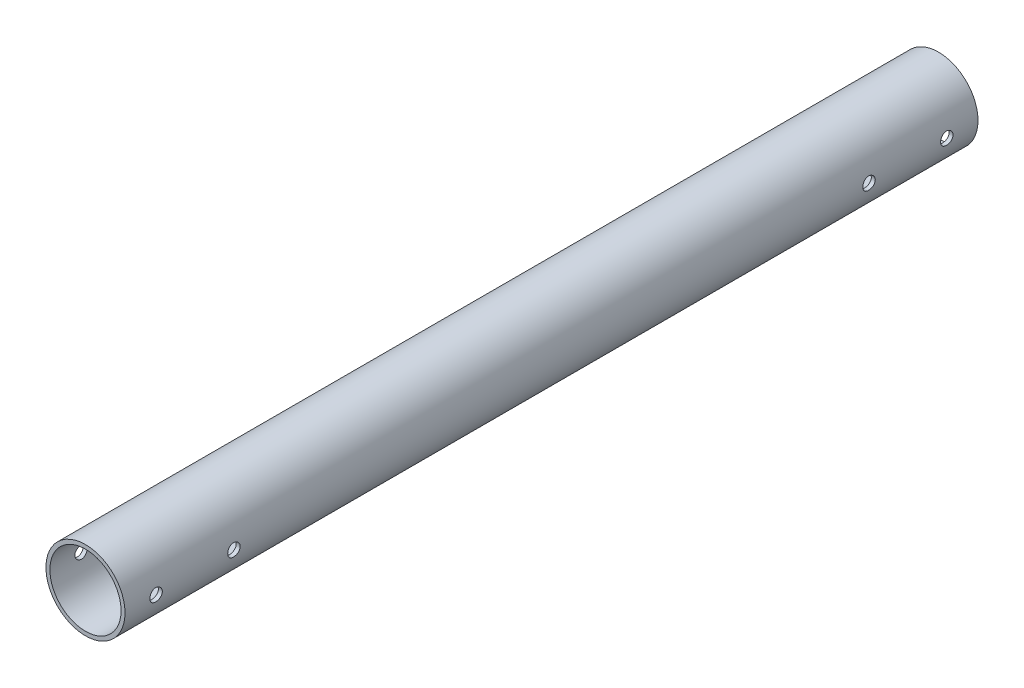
from build123d import *

# Parameters (mm, degrees)
SKETCH1_R               = 12.7
SKETCH1_R_2             = 11.43
BOSS_EXTRUDE1_DEPTH     = 274
CUT_EXTRUDE2_DEPTH      = 275.588018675
CUT_EXTRUDE2_DEPTH_BACK = 275.588018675
SKETCH2_R               = 2


with BuildPart() as part:
    # Sketch1 → Boss-Extrude1 (new body)
    with BuildSketch(Plane(origin=(0, 0, 0), x_dir=(0, 1, 0), z_dir=(0, 0, 1))):
        with Locations(Location((0, 0, 0), (0, 0, 270))):
            Circle(SKETCH1_R)
        with Locations(Location((0, 0, 0), (0, 0, 270))):
            Circle(SKETCH1_R_2, mode=Mode.SUBTRACT)
    extrude(amount=BOSS_EXTRUDE1_DEPTH)

    # Sketch2 → Cut-Extrude2 (cut, two sides: drawn at the far end of the back side and taken through both)
    with BuildSketch(Plane.YZ.offset(-CUT_EXTRUDE2_DEPTH_BACK)):
        with Locations(Location((0, 10, 0), (0, 0, 270))):
            Circle(SKETCH2_R)
        with Locations(Location((0, 35, 0), (0, 0, 270))):
            Circle(SKETCH2_R)
        with Locations(Location((0, 264, 0), (0, 0, 270))):
            Circle(SKETCH2_R)
        with Locations(Location((0, 239, 0), (0, 0, 270))):
            Circle(SKETCH2_R)
    extrude(amount=CUT_EXTRUDE2_DEPTH + CUT_EXTRUDE2_DEPTH_BACK, mode=Mode.SUBTRACT)


solid = part.part
